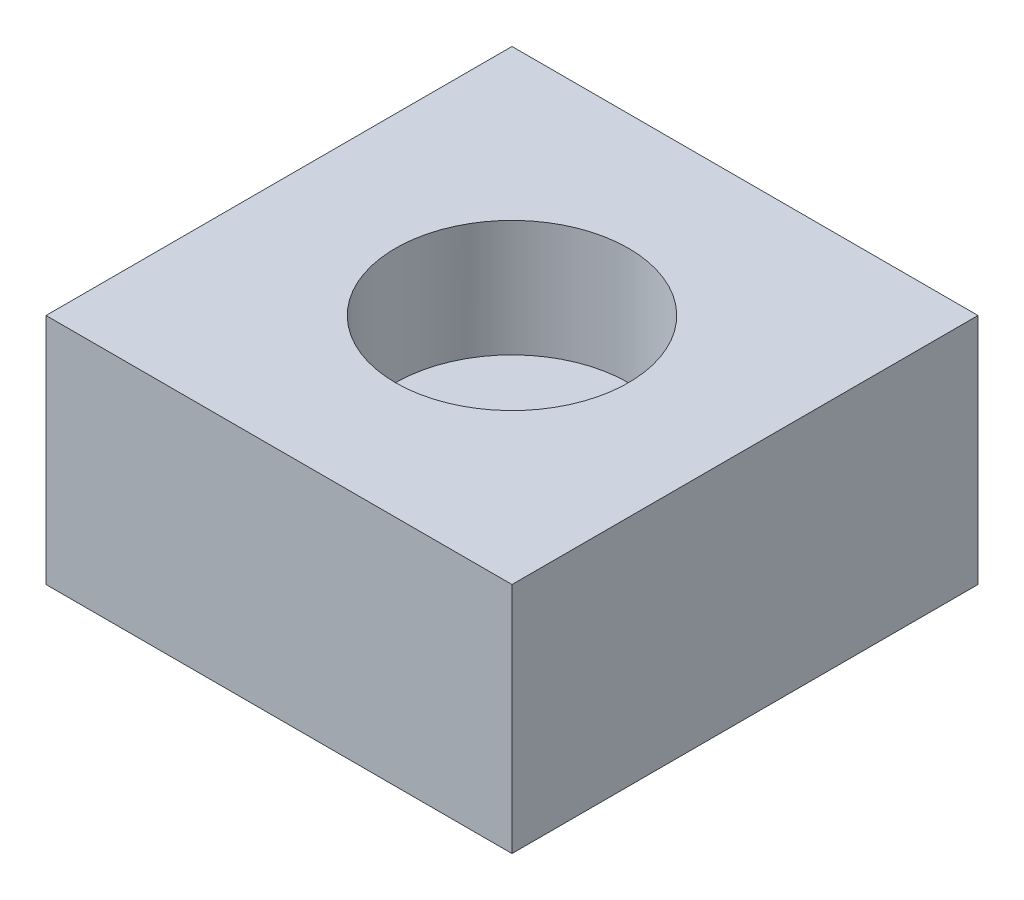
ISO-10303-21;
HEADER;
FILE_DESCRIPTION(('STEP AP214'),'2;1');
FILE_NAME('part.step','',(''),(''),'','','');
FILE_SCHEMA(('AUTOMOTIVE_DESIGN { 1 0 10303 214 1 1 1 1 }'));
ENDSEC;
DATA;
#1=APPLICATION_CONTEXT('core data for automotive mechanical design processes');
#2=APPLICATION_PROTOCOL_DEFINITION('international standard','automotive_design',2000,#1);
#3=PRODUCT_CONTEXT('',#1,'mechanical');
#4=PRODUCT('Part','Part','',(#3));
#5=PRODUCT_RELATED_PRODUCT_CATEGORY('part','',(#4));
#6=PRODUCT_DEFINITION_FORMATION('','',#4);
#7=PRODUCT_DEFINITION_CONTEXT('part definition',#1,'design');
#8=PRODUCT_DEFINITION('design','',#6,#7);
#9=PRODUCT_DEFINITION_SHAPE('','',#8);
#10=(LENGTH_UNIT() NAMED_UNIT(*) SI_UNIT(.MILLI.,.METRE.));
#11=(NAMED_UNIT(*) PLANE_ANGLE_UNIT() SI_UNIT($,.RADIAN.));
#12=(NAMED_UNIT(*) SI_UNIT($,.STERADIAN.) SOLID_ANGLE_UNIT());
#13=UNCERTAINTY_MEASURE_WITH_UNIT(LENGTH_MEASURE(1.E-05),#10,'distance_accuracy_value','');
#14=(GEOMETRIC_REPRESENTATION_CONTEXT(3) GLOBAL_UNCERTAINTY_ASSIGNED_CONTEXT((#13)) GLOBAL_UNIT_ASSIGNED_CONTEXT((#10,
#11,#12)) REPRESENTATION_CONTEXT('',''));
#15=CARTESIAN_POINT('',(0.,0.,0.));
#16=DIRECTION('',(0.,0.,1.));
#17=DIRECTION('',(1.,0.,0.));
#18=AXIS2_PLACEMENT_3D('',#15,#16,#17);
#19=CARTESIAN_POINT('',(1.41168008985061E-13,1000.,0.));
#20=DIRECTION('',(0.,-1.,0.));
#21=DIRECTION('',(0.,0.,-1.));
#22=AXIS2_PLACEMENT_3D('',#19,#20,#21);
#23=CYLINDRICAL_SURFACE('',#22,500.);
#24=CARTESIAN_POINT('',(1.41168008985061E-13,1000.,0.));
#25=DIRECTION('',(0.,1.,0.));
#26=DIRECTION('',(0.,0.,1.));
#27=AXIS2_PLACEMENT_3D('',#24,#25,#26);
#28=CIRCLE('',#27,500.);
#29=CARTESIAN_POINT('',(1.41168008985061E-13,1000.,500.));
#30=VERTEX_POINT('',#29);
#31=EDGE_CURVE('E100',#30,#30,#28,.T.);
#32=ORIENTED_EDGE('',*,*,#31,.T.);
#33=EDGE_LOOP('',(#32));
#34=FACE_BOUND('',#33,.T.);
#35=CARTESIAN_POINT('',(1.41168008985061E-13,500.,0.));
#36=DIRECTION('',(0.,-1.,0.));
#37=DIRECTION('',(0.,0.,-1.));
#38=AXIS2_PLACEMENT_3D('',#35,#36,#37);
#39=CIRCLE('',#38,500.);
#40=CARTESIAN_POINT('',(1.41168008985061E-13,500.,-500.));
#41=VERTEX_POINT('',#40);
#42=EDGE_CURVE('E113',#41,#41,#39,.T.);
#43=ORIENTED_EDGE('',*,*,#42,.T.);
#44=EDGE_LOOP('',(#43));
#45=FACE_BOUND('',#44,.T.);
#46=ADVANCED_FACE('F32',(#34,#45),#23,.F.);
#47=CARTESIAN_POINT('',(0.,1000.,0.));
#48=DIRECTION('',(0.,1.,0.));
#49=DIRECTION('',(0.,0.,1.));
#50=AXIS2_PLACEMENT_3D('',#47,#48,#49);
#51=PLANE('',#50);
#52=DIRECTION('',(0.,0.,-1.));
#53=VECTOR('',#52,1.);
#54=CARTESIAN_POINT('',(1000.,1000.,-1000.));
#55=LINE('',#54,#53);
#56=CARTESIAN_POINT('',(1000.,1000.,1000.));
#57=VERTEX_POINT('',#56);
#58=CARTESIAN_POINT('',(1000.,1000.,-1000.));
#59=VERTEX_POINT('',#58);
#60=EDGE_CURVE('E85',#57,#59,#55,.T.);
#61=ORIENTED_EDGE('',*,*,#60,.T.);
#62=DIRECTION('',(-1.,0.,0.));
#63=VECTOR('',#62,1.);
#64=CARTESIAN_POINT('',(-1000.,1000.,-1000.));
#65=LINE('',#64,#63);
#66=CARTESIAN_POINT('',(-1000.,1000.,-1000.));
#67=VERTEX_POINT('',#66);
#68=EDGE_CURVE('E79',#59,#67,#65,.T.);
#69=ORIENTED_EDGE('',*,*,#68,.T.);
#70=DIRECTION('',(0.,0.,1.));
#71=VECTOR('',#70,1.);
#72=CARTESIAN_POINT('',(-1000.,1000.,-1000.));
#73=LINE('',#72,#71);
#74=CARTESIAN_POINT('',(-1000.,1000.,1000.));
#75=VERTEX_POINT('',#74);
#76=EDGE_CURVE('E83',#67,#75,#73,.T.);
#77=ORIENTED_EDGE('',*,*,#76,.T.);
#78=DIRECTION('',(1.,0.,0.));
#79=VECTOR('',#78,1.);
#80=CARTESIAN_POINT('',(-1000.,1000.,1000.));
#81=LINE('',#80,#79);
#82=EDGE_CURVE('E49',#75,#57,#81,.T.);
#83=ORIENTED_EDGE('',*,*,#82,.T.);
#84=EDGE_LOOP('',(#61,#69,#77,#83));
#85=FACE_BOUND('',#84,.T.);
#86=ORIENTED_EDGE('',*,*,#31,.F.);
#87=EDGE_LOOP('',(#86));
#88=FACE_BOUND('',#87,.T.);
#89=ADVANCED_FACE('F80',(#85,#88),#51,.T.);
#90=CARTESIAN_POINT('',(0.,0.,0.));
#91=DIRECTION('',(0.,1.,0.));
#92=DIRECTION('',(0.,0.,1.));
#93=AXIS2_PLACEMENT_3D('',#90,#91,#92);
#94=PLANE('',#93);
#95=DIRECTION('',(0.,0.,-1.));
#96=VECTOR('',#95,1.);
#97=CARTESIAN_POINT('',(1000.,0.,-1000.));
#98=LINE('',#97,#96);
#99=CARTESIAN_POINT('',(1000.,0.,1000.));
#100=VERTEX_POINT('',#99);
#101=CARTESIAN_POINT('',(1000.,0.,-1000.));
#102=VERTEX_POINT('',#101);
#103=EDGE_CURVE('E97',#100,#102,#98,.T.);
#104=ORIENTED_EDGE('',*,*,#103,.F.);
#105=DIRECTION('',(1.,0.,0.));
#106=VECTOR('',#105,1.);
#107=CARTESIAN_POINT('',(-1000.,0.,1000.));
#108=LINE('',#107,#106);
#109=CARTESIAN_POINT('',(-1000.,0.,1000.));
#110=VERTEX_POINT('',#109);
#111=EDGE_CURVE('E72',#110,#100,#108,.T.);
#112=ORIENTED_EDGE('',*,*,#111,.F.);
#113=DIRECTION('',(0.,0.,1.));
#114=VECTOR('',#113,1.);
#115=CARTESIAN_POINT('',(-1000.,0.,-1000.));
#116=LINE('',#115,#114);
#117=CARTESIAN_POINT('',(-1000.,0.,-1000.));
#118=VERTEX_POINT('',#117);
#119=EDGE_CURVE('E66',#118,#110,#116,.T.);
#120=ORIENTED_EDGE('',*,*,#119,.F.);
#121=DIRECTION('',(-1.,0.,0.));
#122=VECTOR('',#121,1.);
#123=CARTESIAN_POINT('',(-1000.,0.,-1000.));
#124=LINE('',#123,#122);
#125=EDGE_CURVE('E89',#102,#118,#124,.T.);
#126=ORIENTED_EDGE('',*,*,#125,.F.);
#127=EDGE_LOOP('',(#104,#112,#120,#126));
#128=FACE_BOUND('',#127,.T.);
#129=ADVANCED_FACE('F108',(#128),#94,.F.);
#130=CARTESIAN_POINT('',(1000.,1000.,-1000.));
#131=DIRECTION('',(-1.,0.,0.));
#132=DIRECTION('',(0.,0.,1.));
#133=AXIS2_PLACEMENT_3D('',#130,#131,#132);
#134=PLANE('',#133);
#135=ORIENTED_EDGE('',*,*,#103,.T.);
#136=DIRECTION('',(0.,-1.,0.));
#137=VECTOR('',#136,1.);
#138=CARTESIAN_POINT('',(1000.,1000.,-1000.));
#139=LINE('',#138,#137);
#140=EDGE_CURVE('E11',#59,#102,#139,.T.);
#141=ORIENTED_EDGE('',*,*,#140,.F.);
#142=ORIENTED_EDGE('',*,*,#60,.F.);
#143=DIRECTION('',(0.,-1.,0.));
#144=VECTOR('',#143,1.);
#145=CARTESIAN_POINT('',(1000.,1000.,1000.));
#146=LINE('',#145,#144);
#147=EDGE_CURVE('E93',#57,#100,#146,.T.);
#148=ORIENTED_EDGE('',*,*,#147,.T.);
#149=EDGE_LOOP('',(#135,#141,#142,#148));
#150=FACE_BOUND('',#149,.T.);
#151=ADVANCED_FACE('F34',(#150),#134,.F.);
#152=CARTESIAN_POINT('',(-1000.,1000.,-1000.));
#153=DIRECTION('',(0.,0.,1.));
#154=DIRECTION('',(1.,0.,0.));
#155=AXIS2_PLACEMENT_3D('',#152,#153,#154);
#156=PLANE('',#155);
#157=ORIENTED_EDGE('',*,*,#125,.T.);
#158=DIRECTION('',(0.,-1.,0.));
#159=VECTOR('',#158,1.);
#160=CARTESIAN_POINT('',(-1000.,1000.,-1000.));
#161=LINE('',#160,#159);
#162=EDGE_CURVE('E41',#67,#118,#161,.T.);
#163=ORIENTED_EDGE('',*,*,#162,.F.);
#164=ORIENTED_EDGE('',*,*,#68,.F.);
#165=ORIENTED_EDGE('',*,*,#140,.T.);
#166=EDGE_LOOP('',(#157,#163,#164,#165));
#167=FACE_BOUND('',#166,.T.);
#168=ADVANCED_FACE('F88',(#167),#156,.F.);
#169=CARTESIAN_POINT('',(-1000.,1000.,-1000.));
#170=DIRECTION('',(1.,0.,0.));
#171=DIRECTION('',(0.,0.,-1.));
#172=AXIS2_PLACEMENT_3D('',#169,#170,#171);
#173=PLANE('',#172);
#174=ORIENTED_EDGE('',*,*,#119,.T.);
#175=DIRECTION('',(0.,-1.,0.));
#176=VECTOR('',#175,1.);
#177=CARTESIAN_POINT('',(-1000.,1000.,1000.));
#178=LINE('',#177,#176);
#179=EDGE_CURVE('E90',#75,#110,#178,.T.);
#180=ORIENTED_EDGE('',*,*,#179,.F.);
#181=ORIENTED_EDGE('',*,*,#76,.F.);
#182=ORIENTED_EDGE('',*,*,#162,.T.);
#183=EDGE_LOOP('',(#174,#180,#181,#182));
#184=FACE_BOUND('',#183,.T.);
#185=ADVANCED_FACE('F91',(#184),#173,.F.);
#186=CARTESIAN_POINT('',(-1000.,1000.,1000.));
#187=DIRECTION('',(0.,0.,-1.));
#188=DIRECTION('',(-1.,0.,0.));
#189=AXIS2_PLACEMENT_3D('',#186,#187,#188);
#190=PLANE('',#189);
#191=ORIENTED_EDGE('',*,*,#111,.T.);
#192=ORIENTED_EDGE('',*,*,#147,.F.);
#193=ORIENTED_EDGE('',*,*,#82,.F.);
#194=ORIENTED_EDGE('',*,*,#179,.T.);
#195=EDGE_LOOP('',(#191,#192,#193,#194));
#196=FACE_BOUND('',#195,.T.);
#197=ADVANCED_FACE('F105',(#196),#190,.F.);
#198=CARTESIAN_POINT('',(1.41168008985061E-13,500.,0.));
#199=DIRECTION('',(0.,-1.,0.));
#200=DIRECTION('',(0.,0.,-1.));
#201=AXIS2_PLACEMENT_3D('',#198,#199,#200);
#202=PLANE('',#201);
#203=ORIENTED_EDGE('',*,*,#42,.F.);
#204=EDGE_LOOP('',(#203));
#205=FACE_BOUND('',#204,.T.);
#206=ADVANCED_FACE('F118',(#205),#202,.F.);
#207=CLOSED_SHELL('',(#46,#89,#129,#151,#168,#185,#197,#206));
#208=MANIFOLD_SOLID_BREP('B2',#207);
#209=ADVANCED_BREP_SHAPE_REPRESENTATION('',(#18,#208),#14);
#210=SHAPE_DEFINITION_REPRESENTATION(#9,#209);
ENDSEC;
END-ISO-10303-21;
